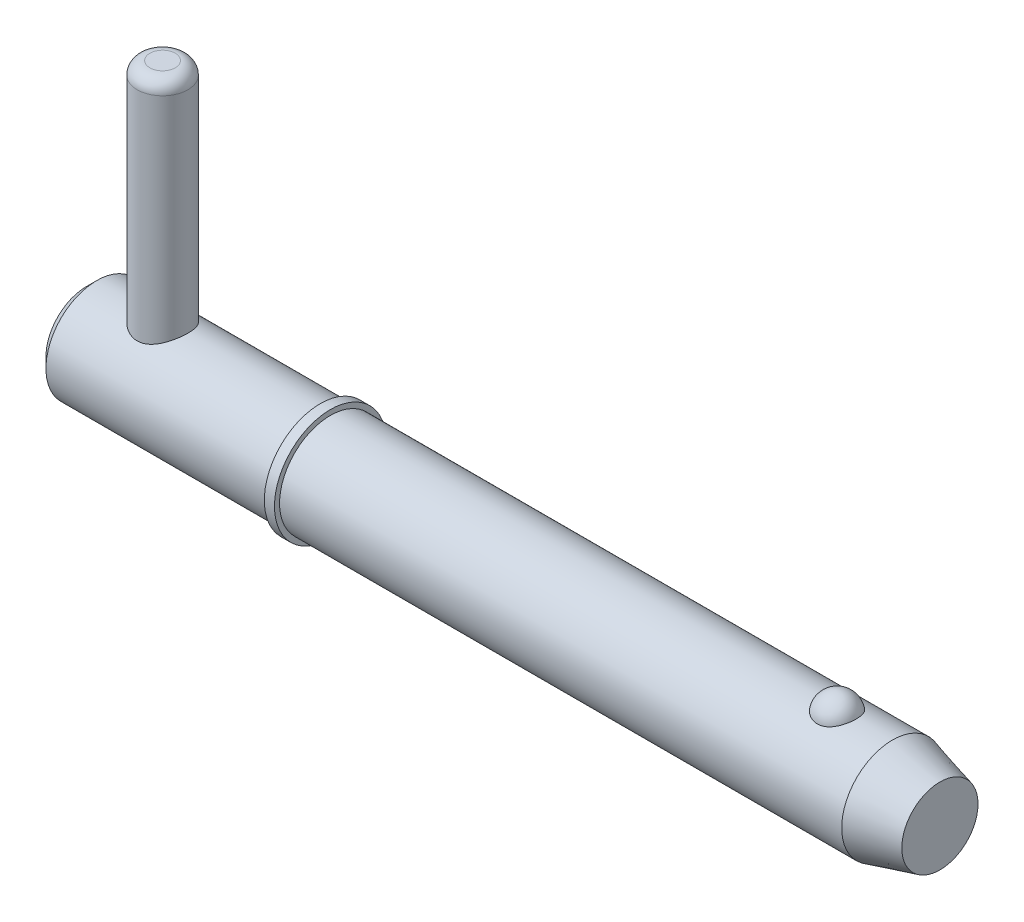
ISO-10303-21;
HEADER;
FILE_DESCRIPTION(('STEP AP214'),'2;1');
FILE_NAME('part.step','',(''),(''),'','','');
FILE_SCHEMA(('AUTOMOTIVE_DESIGN { 1 0 10303 214 1 1 1 1 }'));
ENDSEC;
DATA;
#1=APPLICATION_CONTEXT('core data for automotive mechanical design processes');
#2=APPLICATION_PROTOCOL_DEFINITION('international standard','automotive_design',2000,#1);
#3=PRODUCT_CONTEXT('',#1,'mechanical');
#4=PRODUCT('Part','Part','',(#3));
#5=PRODUCT_RELATED_PRODUCT_CATEGORY('part','',(#4));
#6=PRODUCT_DEFINITION_FORMATION('','',#4);
#7=PRODUCT_DEFINITION_CONTEXT('part definition',#1,'design');
#8=PRODUCT_DEFINITION('design','',#6,#7);
#9=PRODUCT_DEFINITION_SHAPE('','',#8);
#10=(LENGTH_UNIT() NAMED_UNIT(*) SI_UNIT(.MILLI.,.METRE.));
#11=(NAMED_UNIT(*) PLANE_ANGLE_UNIT() SI_UNIT($,.RADIAN.));
#12=(NAMED_UNIT(*) SI_UNIT($,.STERADIAN.) SOLID_ANGLE_UNIT());
#13=UNCERTAINTY_MEASURE_WITH_UNIT(LENGTH_MEASURE(1.E-05),#10,'distance_accuracy_value','');
#14=(GEOMETRIC_REPRESENTATION_CONTEXT(3) GLOBAL_UNCERTAINTY_ASSIGNED_CONTEXT((#13)) GLOBAL_UNIT_ASSIGNED_CONTEXT((#10,
#11,#12)) REPRESENTATION_CONTEXT('',''));
#15=CARTESIAN_POINT('',(0.,0.,0.));
#16=DIRECTION('',(0.,0.,1.));
#17=DIRECTION('',(1.,0.,0.));
#18=AXIS2_PLACEMENT_3D('',#15,#16,#17);
#19=CARTESIAN_POINT('',(5.94,21.43,0.));
#20=DIRECTION('',(0.,-1.,0.));
#21=DIRECTION('',(0.,0.,-1.));
#22=AXIS2_PLACEMENT_3D('',#19,#20,#21);
#23=CYLINDRICAL_SURFACE('',#22,1.98);
#24=CARTESIAN_POINT('',(5.94,-2.98,0.));
#25=DIRECTION('',(0.,1.,0.));
#26=DIRECTION('',(0.,0.,1.));
#27=AXIS2_PLACEMENT_3D('',#24,#25,#26);
#28=CIRCLE('',#27,1.98);
#29=CARTESIAN_POINT('',(5.94,-2.98,1.98));
#30=VERTEX_POINT('',#29);
#31=EDGE_CURVE('P0_E25',#30,#30,#28,.T.);
#32=ORIENTED_EDGE('',*,*,#31,.T.);
#33=EDGE_LOOP('',(#32));
#34=FACE_BOUND('',#33,.T.);
#35=CARTESIAN_POINT('',(5.94,20.44,0.));
#36=DIRECTION('',(0.,1.,0.));
#37=DIRECTION('',(0.,0.,1.));
#38=AXIS2_PLACEMENT_3D('',#35,#36,#37);
#39=CIRCLE('',#38,1.98);
#40=CARTESIAN_POINT('',(5.94,20.44,1.98));
#41=VERTEX_POINT('',#40);
#42=EDGE_CURVE('P0_E29',#41,#41,#39,.F.);
#43=ORIENTED_EDGE('',*,*,#42,.T.);
#44=EDGE_LOOP('',(#43));
#45=FACE_BOUND('',#44,.T.);
#46=ADVANCED_FACE('P0_F14',(#34,#45),#23,.T.);
#47=CARTESIAN_POINT('',(5.94,21.43,0.));
#48=DIRECTION('',(0.,1.,0.));
#49=DIRECTION('',(0.,0.,1.));
#50=AXIS2_PLACEMENT_3D('',#47,#48,#49);
#51=PLANE('',#50);
#52=CARTESIAN_POINT('',(5.94,21.43,0.));
#53=DIRECTION('',(0.,1.,0.));
#54=DIRECTION('',(0.,0.,1.));
#55=AXIS2_PLACEMENT_3D('',#52,#53,#54);
#56=CIRCLE('',#55,0.99);
#57=CARTESIAN_POINT('',(5.94,21.43,0.99));
#58=VERTEX_POINT('',#57);
#59=EDGE_CURVE('P0_E10',#58,#58,#56,.T.);
#60=ORIENTED_EDGE('',*,*,#59,.T.);
#61=EDGE_LOOP('',(#60));
#62=FACE_BOUND('',#61,.T.);
#63=ADVANCED_FACE('P0_F46',(#62),#51,.T.);
#64=CARTESIAN_POINT('',(5.94,-3.97,0.));
#65=DIRECTION('',(0.,1.,0.));
#66=DIRECTION('',(0.,0.,1.));
#67=AXIS2_PLACEMENT_3D('',#64,#65,#66);
#68=PLANE('',#67);
#69=CARTESIAN_POINT('',(5.94,-3.97,0.));
#70=DIRECTION('',(0.,1.,0.));
#71=DIRECTION('',(0.,0.,1.));
#72=AXIS2_PLACEMENT_3D('',#69,#70,#71);
#73=CIRCLE('',#72,0.99);
#74=CARTESIAN_POINT('',(5.94,-3.97,0.99));
#75=VERTEX_POINT('',#74);
#76=EDGE_CURVE('P0_E21',#75,#75,#73,.F.);
#77=ORIENTED_EDGE('',*,*,#76,.T.);
#78=EDGE_LOOP('',(#77));
#79=FACE_BOUND('',#78,.T.);
#80=ADVANCED_FACE('P0_F43',(#79),#68,.F.);
#81=CARTESIAN_POINT('',(5.94,-2.98,0.));
#82=DIRECTION('',(0.,1.,0.));
#83=DIRECTION('',(0.,0.,1.));
#84=AXIS2_PLACEMENT_3D('',#81,#82,#83);
#85=DEGENERATE_TOROIDAL_SURFACE('',#84,0.99,0.99,.T.);
#86=ORIENTED_EDGE('',*,*,#76,.F.);
#87=EDGE_LOOP('',(#86));
#88=FACE_BOUND('',#87,.T.);
#89=ORIENTED_EDGE('',*,*,#31,.F.);
#90=EDGE_LOOP('',(#89));
#91=FACE_BOUND('',#90,.T.);
#92=ADVANCED_FACE('P0_F38',(#88,#91),#85,.T.);
#93=CARTESIAN_POINT('',(5.94,20.44,0.));
#94=DIRECTION('',(0.,1.,0.));
#95=DIRECTION('',(0.,0.,1.));
#96=AXIS2_PLACEMENT_3D('',#93,#94,#95);
#97=DEGENERATE_TOROIDAL_SURFACE('',#96,0.99,0.99,.T.);
#98=ORIENTED_EDGE('',*,*,#42,.F.);
#99=EDGE_LOOP('',(#98));
#100=FACE_BOUND('',#99,.T.);
#101=ORIENTED_EDGE('',*,*,#59,.F.);
#102=EDGE_LOOP('',(#101));
#103=FACE_BOUND('',#102,.T.);
#104=ADVANCED_FACE('P0_F16',(#100,#103),#97,.T.);
#105=CLOSED_SHELL('',(#46,#63,#80,#92,#104));
#106=MANIFOLD_SOLID_BREP('P0_B1',#105);
#107=CARTESIAN_POINT('',(0.,0.,0.));
#108=DIRECTION('',(1.,0.,0.));
#109=DIRECTION('',(0.,0.,-1.));
#110=AXIS2_PLACEMENT_3D('',#107,#108,#109);
#111=CYLINDRICAL_SURFACE('',#110,3.97);
#112=CARTESIAN_POINT('',(62.9759395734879,0.,0.));
#113=DIRECTION('',(1.,0.,0.));
#114=DIRECTION('',(0.,0.,-1.));
#115=AXIS2_PLACEMENT_3D('',#112,#113,#114);
#116=CIRCLE('',#115,3.97);
#117=CARTESIAN_POINT('',(62.9759395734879,0.,-3.97));
#118=VERTEX_POINT('',#117);
#119=EDGE_CURVE('P1_E81',#118,#118,#116,.T.);
#120=ORIENTED_EDGE('',*,*,#119,.F.);
#121=EDGE_LOOP('',(#120));
#122=FACE_BOUND('',#121,.T.);
#123=CARTESIAN_POINT('',(19.05,0.,0.));
#124=DIRECTION('',(1.,0.,0.));
#125=DIRECTION('',(0.,0.,-1.));
#126=AXIS2_PLACEMENT_3D('',#123,#124,#125);
#127=CIRCLE('',#126,3.97);
#128=CARTESIAN_POINT('',(19.05,0.,-3.97));
#129=VERTEX_POINT('',#128);
#130=EDGE_CURVE('P1_E85',#129,#129,#127,.T.);
#131=ORIENTED_EDGE('',*,*,#130,.T.);
#132=EDGE_LOOP('',(#131));
#133=FACE_BOUND('',#132,.T.);
#134=CARTESIAN_POINT('',(58.6451922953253,3.65715365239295,1.54470941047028));
#135=CARTESIAN_POINT('',(58.5652448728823,3.65716001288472,1.54470290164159));
#136=CARTESIAN_POINT('',(58.4851650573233,3.65987074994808,1.53832549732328));
#137=CARTESIAN_POINT('',(58.3272374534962,3.6704221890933,1.51297018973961));
#138=CARTESIAN_POINT('',(58.2493961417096,3.67827646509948,1.49395894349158));
#139=CARTESIAN_POINT('',(58.0984614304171,3.69818848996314,1.44395950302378));
#140=CARTESIAN_POINT('',(58.0253560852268,3.71023513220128,1.41300293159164));
#141=CARTESIAN_POINT('',(57.8855630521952,3.7372183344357,1.34000212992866));
#142=CARTESIAN_POINT('',(57.8188725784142,3.75215363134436,1.29796274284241));
#143=CARTESIAN_POINT('',(57.6914886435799,3.78384968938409,1.20248834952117));
#144=CARTESIAN_POINT('',(57.6310299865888,3.80065129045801,1.14875388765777));
#145=CARTESIAN_POINT('',(57.5196942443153,3.83398532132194,1.03205417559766));
#146=CARTESIAN_POINT('',(57.4688200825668,3.85051766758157,0.969086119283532));
#147=CARTESIAN_POINT('',(57.3756321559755,3.88238608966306,0.832526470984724));
#148=CARTESIAN_POINT('',(57.3337961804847,3.89763698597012,0.758588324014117));
#149=CARTESIAN_POINT('',(57.2625108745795,3.92451063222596,0.604352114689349));
#150=CARTESIAN_POINT('',(57.2330623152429,3.93613315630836,0.524053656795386));
#151=CARTESIAN_POINT('',(57.1868927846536,3.95467606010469,0.358403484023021));
#152=CARTESIAN_POINT('',(57.1703127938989,3.96154426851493,0.273006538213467));
#153=CARTESIAN_POINT('',(57.150756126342,3.96967008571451,0.100408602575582));
#154=CARTESIAN_POINT('',(57.1477789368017,3.97092790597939,0.0132076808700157));
#155=CARTESIAN_POINT('',(57.1554587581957,3.96771794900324,-0.159844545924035));
#156=CARTESIAN_POINT('',(57.1660164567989,3.96329187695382,-0.245701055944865));
#157=CARTESIAN_POINT('',(57.2003800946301,3.94923163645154,-0.414277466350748));
#158=CARTESIAN_POINT('',(57.2241862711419,3.93959737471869,-0.496997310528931));
#159=CARTESIAN_POINT('',(57.2846114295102,3.91607752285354,-0.657113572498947));
#160=CARTESIAN_POINT('',(57.3212495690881,3.90218558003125,-0.734501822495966));
#161=CARTESIAN_POINT('',(57.4065935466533,3.87158287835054,-0.881704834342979));
#162=CARTESIAN_POINT('',(57.4553004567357,3.8548718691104,-0.951518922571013));
#163=CARTESIAN_POINT('',(57.5641161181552,3.82028735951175,-1.08208159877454));
#164=CARTESIAN_POINT('',(57.6242955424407,3.80240713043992,-1.14276958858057));
#165=CARTESIAN_POINT('',(57.754493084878,3.76758161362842,-1.2528243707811));
#166=CARTESIAN_POINT('',(57.8245105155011,3.75063626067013,-1.30219195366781));
#167=CARTESIAN_POINT('',(57.97118160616,3.71998948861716,-1.38729709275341));
#168=CARTESIAN_POINT('',(58.0476813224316,3.70623183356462,-1.42327904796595));
#169=CARTESIAN_POINT('',(58.2062981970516,3.68323188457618,-1.48178996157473));
#170=CARTESIAN_POINT('',(58.2884132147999,3.67398788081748,-1.5043240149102));
#171=CARTESIAN_POINT('',(58.4514810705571,3.6615216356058,-1.53440939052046));
#172=CARTESIAN_POINT('',(58.5322840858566,3.65801951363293,-1.54265826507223));
#173=CARTESIAN_POINT('',(58.6942085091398,3.65657341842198,-1.5460842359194));
#174=CARTESIAN_POINT('',(58.7753298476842,3.65862829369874,-1.54126404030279));
#175=CARTESIAN_POINT('',(58.9328122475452,3.66788969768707,-1.51908474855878));
#176=CARTESIAN_POINT('',(59.0092422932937,3.67492621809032,-1.50213925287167));
#177=CARTESIAN_POINT('',(59.1580412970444,3.69318404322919,-1.45666982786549));
#178=CARTESIAN_POINT('',(59.2304099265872,3.70440568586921,-1.42814496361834));
#179=CARTESIAN_POINT('',(59.3708029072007,3.73012749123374,-1.35956319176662));
#180=CARTESIAN_POINT('',(59.4387000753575,3.74469307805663,-1.31927107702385));
#181=CARTESIAN_POINT('',(59.5668649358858,3.77545272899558,-1.22847440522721));
#182=CARTESIAN_POINT('',(59.6271308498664,3.79164717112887,-1.17796747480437));
#183=CARTESIAN_POINT('',(59.7416346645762,3.82490325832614,-1.06519260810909));
#184=CARTESIAN_POINT('',(59.7954137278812,3.84196735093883,-1.00245914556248));
#185=CARTESIAN_POINT('',(59.8920988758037,3.87439863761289,-0.86871586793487));
#186=CARTESIAN_POINT('',(59.9350030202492,3.88976552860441,-0.797704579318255));
#187=CARTESIAN_POINT('',(60.010266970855,3.91771381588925,-0.646896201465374));
#188=CARTESIAN_POINT('',(60.0422532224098,3.93019255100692,-0.566893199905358));
#189=CARTESIAN_POINT('',(60.0931101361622,3.95043886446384,-0.402255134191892));
#190=CARTESIAN_POINT('',(60.1119807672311,3.95820643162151,-0.317620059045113));
#191=CARTESIAN_POINT('',(60.1362162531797,3.96823733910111,-0.146156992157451));
#192=CARTESIAN_POINT('',(60.1415874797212,3.970503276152,-0.0593300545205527));
#193=CARTESIAN_POINT('',(60.1387309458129,3.96930811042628,0.114057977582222));
#194=CARTESIAN_POINT('',(60.130503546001,3.9658471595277,0.200619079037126));
#195=CARTESIAN_POINT('',(60.1007063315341,3.95358562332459,0.370506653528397));
#196=CARTESIAN_POINT('',(60.0792129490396,3.94481563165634,0.453848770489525));
#197=CARTESIAN_POINT('',(60.0233839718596,3.92284586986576,0.615497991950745));
#198=CARTESIAN_POINT('',(59.9890474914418,3.90964579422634,0.69380474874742));
#199=CARTESIAN_POINT('',(59.9079702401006,3.88006987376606,0.843703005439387));
#200=CARTESIAN_POINT('',(59.8611536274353,3.86367478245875,0.915249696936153));
#201=CARTESIAN_POINT('',(59.7561897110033,3.82949741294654,1.04910810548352));
#202=CARTESIAN_POINT('',(59.6980428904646,3.81171519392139,1.11142021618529));
#203=CARTESIAN_POINT('',(59.5717433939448,3.77673366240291,1.22503948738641));
#204=CARTESIAN_POINT('',(59.5035970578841,3.75953398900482,1.27635357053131));
#205=CARTESIAN_POINT('',(59.3589009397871,3.72770506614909,1.36653336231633));
#206=CARTESIAN_POINT('',(59.282348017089,3.71307678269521,1.40539439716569));
#207=CARTESIAN_POINT('',(59.1257594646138,3.68864287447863,1.46830480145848));
#208=CARTESIAN_POINT('',(59.0459307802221,3.67869017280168,1.49281289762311));
#209=CARTESIAN_POINT('',(58.8829877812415,3.66414535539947,1.52817474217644));
#210=CARTESIAN_POINT('',(58.7998840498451,3.65953723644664,1.53906926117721));
#211=CARTESIAN_POINT('',(58.6927760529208,3.6573894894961,1.54414878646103));
#212=CARTESIAN_POINT('',(58.6689900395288,3.65715175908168,1.54471134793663));
#213=CARTESIAN_POINT('',(58.6451922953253,3.65715365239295,1.54470941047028));
#214=B_SPLINE_CURVE_WITH_KNOTS('',3,(#134,#135,#136,#137,#138,#139,#140,#141,#142,#143,#144,
#145,#146,#147,#148,#149,#150,#151,#152,#153,#154,#155,#156,#157,#158,#159,#160,#161,#162,#163,
#164,#165,#166,#167,#168,#169,#170,#171,#172,#173,#174,#175,#176,#177,#178,#179,#180,#181,#182,
#183,#184,#185,#186,#187,#188,#189,#190,#191,#192,#193,#194,#195,#196,#197,#198,#199,#200,#201,
#202,#203,#204,#205,#206,#207,#208,#209,#210,#211,#212,#213),.UNSPECIFIED.,.T.,.F.,(4,2,2,2,2,2,
2,2,2,2,2,2,2,2,2,2,2,2,2,2,2,2,2,2,2,2,2,2,2,2,2,2,2,2,2,2,2,2,2,4),(0.,0.239777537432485,
0.480190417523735,0.719971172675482,0.959647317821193,1.20639040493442,1.45320863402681,
1.7109367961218,1.96868099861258,2.22921052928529,2.48973023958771,2.74834928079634,
3.00697295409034,3.26598440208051,3.52501886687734,3.78570385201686,4.04637062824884,
4.30201257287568,4.55755760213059,4.80022994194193,5.04285200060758,5.27757006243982,
5.51230707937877,5.75210128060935,5.99195126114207,6.24392810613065,6.49594987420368,
6.75588818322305,7.01582710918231,7.27564332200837,7.53545264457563,7.79377886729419,
8.0521229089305,8.31207418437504,8.57201437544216,8.83179046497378,9.09166393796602,
9.34270057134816,9.59298357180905,9.66435753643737),.UNSPECIFIED.);
#215=CARTESIAN_POINT('',(58.6451922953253,3.65715365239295,1.54470941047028));
#216=VERTEX_POINT('',#215);
#217=EDGE_CURVE('P1_E35',#216,#216,#214,.T.);
#218=ORIENTED_EDGE('',*,*,#217,.T.);
#219=EDGE_LOOP('',(#218));
#220=FACE_BOUND('',#219,.T.);
#221=ADVANCED_FACE('P1_F13',(#122,#133,#220),#111,.T.);
#222=CARTESIAN_POINT('',(0.,0.,0.));
#223=DIRECTION('',(-1.,0.,0.));
#224=DIRECTION('',(0.,0.,1.));
#225=AXIS2_PLACEMENT_3D('',#222,#223,#224);
#226=PLANE('',#225);
#227=CARTESIAN_POINT('',(0.,0.,0.));
#228=DIRECTION('',(1.,0.,0.));
#229=DIRECTION('',(0.,0.,-1.));
#230=AXIS2_PLACEMENT_3D('',#227,#228,#229);
#231=CIRCLE('',#230,3.176);
#232=CARTESIAN_POINT('',(0.,0.,-3.176));
#233=VERTEX_POINT('',#232);
#234=EDGE_CURVE('P1_E9',#233,#233,#231,.T.);
#235=ORIENTED_EDGE('',*,*,#234,.F.);
#236=EDGE_LOOP('',(#235));
#237=FACE_BOUND('',#236,.T.);
#238=ADVANCED_FACE('P1_F15',(#237),#226,.T.);
#239=CARTESIAN_POINT('',(0.793999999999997,0.,0.));
#240=DIRECTION('',(1.,0.,0.));
#241=DIRECTION('',(0.,0.,-1.));
#242=AXIS2_PLACEMENT_3D('',#239,#240,#241);
#243=CONICAL_SURFACE('',#242,3.97,0.78539816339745);
#244=ORIENTED_EDGE('',*,*,#234,.T.);
#245=EDGE_LOOP('',(#244));
#246=FACE_BOUND('',#245,.T.);
#247=CARTESIAN_POINT('',(0.793999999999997,0.,0.));
#248=DIRECTION('',(1.,0.,0.));
#249=DIRECTION('',(0.,0.,-1.));
#250=AXIS2_PLACEMENT_3D('',#247,#248,#249);
#251=CIRCLE('',#250,3.97);
#252=CARTESIAN_POINT('',(0.793999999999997,0.,-3.97));
#253=VERTEX_POINT('',#252);
#254=EDGE_CURVE('P1_E26',#253,#253,#251,.T.);
#255=ORIENTED_EDGE('',*,*,#254,.F.);
#256=EDGE_LOOP('',(#255));
#257=FACE_BOUND('',#256,.T.);
#258=ADVANCED_FACE('P1_F77',(#246,#257),#243,.T.);
#259=CARTESIAN_POINT('',(0.,0.,0.));
#260=DIRECTION('',(1.,0.,0.));
#261=DIRECTION('',(0.,0.,-1.));
#262=AXIS2_PLACEMENT_3D('',#259,#260,#261);
#263=CYLINDRICAL_SURFACE('',#262,3.97);
#264=CARTESIAN_POINT('',(5.94,-3.44100276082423,1.98));
#265=CARTESIAN_POINT('',(5.8367885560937,-3.44101282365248,1.97999171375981));
#266=CARTESIAN_POINT('',(5.73344176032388,-3.44571749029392,1.97187534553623));
#267=CARTESIAN_POINT('',(5.52991905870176,-3.46385873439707,1.93981946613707));
#268=CARTESIAN_POINT('',(5.42975031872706,-3.47731375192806,1.91584653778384));
#269=CARTESIAN_POINT('',(5.23590869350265,-3.51100678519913,1.85336773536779));
#270=CARTESIAN_POINT('',(5.14220446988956,-3.53120882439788,1.81493880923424));
#271=CARTESIAN_POINT('',(4.9625969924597,-3.57606420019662,1.72487335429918));
#272=CARTESIAN_POINT('',(4.87669412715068,-3.6007177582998,1.67323616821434));
#273=CARTESIAN_POINT('',(4.70734412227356,-3.65417020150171,1.55325205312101));
#274=CARTESIAN_POINT('',(4.62467662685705,-3.68314323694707,1.4838818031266));
#275=CARTESIAN_POINT('',(4.47154355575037,-3.74056406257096,1.33252902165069));
#276=CARTESIAN_POINT('',(4.40108404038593,-3.76901158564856,1.25054026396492));
#277=CARTESIAN_POINT('',(4.26974803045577,-3.82445556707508,1.06956584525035));
#278=CARTESIAN_POINT('',(4.20982960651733,-3.8512271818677,0.969809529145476));
#279=CARTESIAN_POINT('',(4.10798077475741,-3.89804342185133,0.760047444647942));
#280=CARTESIAN_POINT('',(4.06603907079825,-3.91809226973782,0.650048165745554));
#281=CARTESIAN_POINT('',(4.00441878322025,-3.94794912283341,0.431181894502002));
#282=CARTESIAN_POINT('',(3.98337329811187,-3.95838209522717,0.322786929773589));
#283=CARTESIAN_POINT('',(3.9596425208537,-3.97016407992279,0.103541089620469));
#284=CARTESIAN_POINT('',(3.95694618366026,-3.97151855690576,-0.00730826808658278));
#285=CARTESIAN_POINT('',(3.9694599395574,-3.96528826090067,-0.218044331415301));
#286=CARTESIAN_POINT('',(3.98314071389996,-3.95846689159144,-0.318049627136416));
#287=CARTESIAN_POINT('',(4.02528522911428,-3.93780347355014,-0.514124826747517));
#288=CARTESIAN_POINT('',(4.05375007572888,-3.92396089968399,-0.61019443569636));
#289=CARTESIAN_POINT('',(4.12484256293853,-3.89028355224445,-0.797351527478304));
#290=CARTESIAN_POINT('',(4.16766142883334,-3.87036821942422,-0.888351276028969));
#291=CARTESIAN_POINT('',(4.26598377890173,-3.82634285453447,-1.06209448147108));
#292=CARTESIAN_POINT('',(4.32149181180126,-3.8022313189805,-1.14483496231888));
#293=CARTESIAN_POINT('',(4.44962332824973,-3.74940011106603,-1.30802500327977));
#294=CARTESIAN_POINT('',(4.52336636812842,-3.72046031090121,-1.38752498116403));
#295=CARTESIAN_POINT('',(4.68287656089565,-3.66269463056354,-1.53354043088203));
#296=CARTESIAN_POINT('',(4.7686527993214,-3.63386885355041,-1.60004599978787));
#297=CARTESIAN_POINT('',(4.9564069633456,-3.57763161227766,-1.72228426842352));
#298=CARTESIAN_POINT('',(5.05906485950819,-3.5504233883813,-1.77707534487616));
#299=CARTESIAN_POINT('',(5.27381412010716,-3.50334038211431,-1.86819784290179));
#300=CARTESIAN_POINT('',(5.38589553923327,-3.48345798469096,-1.90454844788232));
#301=CARTESIAN_POINT('',(5.6069795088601,-3.45548331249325,-1.95481643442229));
#302=CARTESIAN_POINT('',(5.71552407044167,-3.44658268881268,-1.97028113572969));
#303=CARTESIAN_POINT('',(5.93399639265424,-3.43928114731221,-1.98300600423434));
#304=CARTESIAN_POINT('',(6.04392313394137,-3.44087289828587,-1.98027888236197));
#305=CARTESIAN_POINT('',(6.24931618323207,-3.45351901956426,-1.95811780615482));
#306=CARTESIAN_POINT('',(6.34505668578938,-3.46352725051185,-1.94052989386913));
#307=CARTESIAN_POINT('',(6.53204702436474,-3.49033612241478,-1.89188242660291));
#308=CARTESIAN_POINT('',(6.62329540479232,-3.50713894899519,-1.86081853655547));
#309=CARTESIAN_POINT('',(6.80352105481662,-3.54655680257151,-1.78458666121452));
#310=CARTESIAN_POINT('',(6.89219712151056,-3.56940508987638,-1.73883178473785));
#311=CARTESIAN_POINT('',(7.06112449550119,-3.61813012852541,-1.63502913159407));
#312=CARTESIAN_POINT('',(7.14137144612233,-3.6440084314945,-1.57697504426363));
#313=CARTESIAN_POINT('',(7.30168083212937,-3.69977514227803,-1.44171920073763));
#314=CARTESIAN_POINT('',(7.38046039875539,-3.7297597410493,-1.36302972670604));
#315=CARTESIAN_POINT('',(7.52409649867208,-3.78754991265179,-1.19307190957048));
#316=CARTESIAN_POINT('',(7.58894840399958,-3.81535475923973,-1.10179940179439));
#317=CARTESIAN_POINT('',(7.70430122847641,-3.86658972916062,-0.906019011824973));
#318=CARTESIAN_POINT('',(7.75438714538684,-3.88988795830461,-0.801229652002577));
#319=CARTESIAN_POINT('',(7.83572184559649,-3.92848199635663,-0.583216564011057));
#320=CARTESIAN_POINT('',(7.86698708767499,-3.94378479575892,-0.470000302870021));
#321=CARTESIAN_POINT('',(7.90711051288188,-3.96355307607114,-0.249525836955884));
#322=CARTESIAN_POINT('',(7.91775648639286,-3.96888171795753,-0.142669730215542));
#323=CARTESIAN_POINT('',(7.92160247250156,-3.97079858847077,0.0714191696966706));
#324=CARTESIAN_POINT('',(7.91480852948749,-3.96738984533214,0.178651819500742));
#325=CARTESIAN_POINT('',(7.88515479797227,-3.9527181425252,0.383072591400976));
#326=CARTESIAN_POINT('',(7.8633739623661,-3.94198303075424,0.480459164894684));
#327=CARTESIAN_POINT('',(7.80581513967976,-3.91422178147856,0.670038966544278));
#328=CARTESIAN_POINT('',(7.77003513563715,-3.89719473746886,0.762231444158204));
#329=CARTESIAN_POINT('',(7.68389191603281,-3.85747818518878,0.943248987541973));
#330=CARTESIAN_POINT('',(7.63296879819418,-3.83457704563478,1.03175978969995));
#331=CARTESIAN_POINT('',(7.51869140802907,-3.7855122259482,1.19934744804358));
#332=CARTESIAN_POINT('',(7.45533142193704,-3.75934704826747,1.2784199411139));
#333=CARTESIAN_POINT('',(7.31068939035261,-3.70329841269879,1.433144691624));
#334=CARTESIAN_POINT('',(7.22825362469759,-3.67330340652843,1.50768183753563));
#335=CARTESIAN_POINT('',(7.05162367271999,-3.61514025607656,1.64226879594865));
#336=CARTESIAN_POINT('',(6.95741928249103,-3.58697372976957,1.70230590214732));
#337=CARTESIAN_POINT('',(6.75590859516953,-3.53504049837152,1.80775364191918));
#338=CARTESIAN_POINT('',(6.64828786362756,-3.51143624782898,1.85265616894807));
#339=CARTESIAN_POINT('',(6.48137774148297,-3.48289659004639,1.90544537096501));
#340=CARTESIAN_POINT('',(6.42488151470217,-3.4745323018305,1.9206071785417));
#341=CARTESIAN_POINT('',(6.31046920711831,-3.4604244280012,1.94591259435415));
#342=CARTESIAN_POINT('',(6.25255415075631,-3.45467900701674,1.95605971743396));
#343=CARTESIAN_POINT('',(6.1521444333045,-3.44728060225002,1.96905939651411));
#344=CARTESIAN_POINT('',(6.10985721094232,-3.44493297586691,1.97315742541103));
#345=CARTESIAN_POINT('',(6.02505433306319,-3.44179192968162,1.97862952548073));
#346=CARTESIAN_POINT('',(5.98253866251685,-3.44099861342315,1.98000341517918));
#347=CARTESIAN_POINT('',(5.94,-3.44100276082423,1.98));
#348=B_SPLINE_CURVE_WITH_KNOTS('',3,(#264,#265,#266,#267,#268,#269,#270,#271,#272,#273,#274,
#275,#276,#277,#278,#279,#280,#281,#282,#283,#284,#285,#286,#287,#288,#289,#290,#291,#292,#293,
#294,#295,#296,#297,#298,#299,#300,#301,#302,#303,#304,#305,#306,#307,#308,#309,#310,#311,#312,
#313,#314,#315,#316,#317,#318,#319,#320,#321,#322,#323,#324,#325,#326,#327,#328,#329,#330,#331,
#332,#333,#334,#335,#336,#337,#338,#339,#340,#341,#342,#343,#344,#345,#346,#347),.UNSPECIFIED.,
.T.,.F.,(4,2,2,2,2,2,2,2,2,2,2,2,2,2,2,2,2,2,2,2,2,2,2,2,2,2,2,2,2,2,2,2,2,2,2,2,2,2,2,2,2,4),
(0.,0.309462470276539,0.619579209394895,0.928068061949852,1.23657226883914,1.57038619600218,
1.90436536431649,2.26071614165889,2.61684266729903,2.94773555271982,3.27842924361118,
3.58050679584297,3.88260694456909,4.18890317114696,4.49530936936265,4.83057163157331,
5.1660884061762,5.52272472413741,5.87898927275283,6.20706708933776,6.53491569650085,
6.82716910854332,7.11951660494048,7.42541184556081,7.73146442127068,8.07586334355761,
8.42037652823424,8.77380887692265,9.12693169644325,9.44775848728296,9.76847409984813,
10.0682302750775,10.3680296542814,10.6806938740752,10.9935020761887,11.3373031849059,
11.6814044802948,12.0361164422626,12.2131519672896,12.3900632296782,12.5175998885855,
12.6451450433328),.UNSPECIFIED.);
#349=CARTESIAN_POINT('',(5.94,-3.44100276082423,1.98));
#350=VERTEX_POINT('',#349);
#351=EDGE_CURVE('P1_E17',#350,#350,#348,.T.);
#352=ORIENTED_EDGE('',*,*,#351,.F.);
#353=EDGE_LOOP('',(#352));
#354=FACE_BOUND('',#353,.T.);
#355=CARTESIAN_POINT('',(5.94,3.44100276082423,1.98));
#356=CARTESIAN_POINT('',(6.0432114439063,3.44101282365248,1.97999171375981));
#357=CARTESIAN_POINT('',(6.14655823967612,3.44571749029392,1.97187534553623));
#358=CARTESIAN_POINT('',(6.35008094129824,3.46385873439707,1.93981946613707));
#359=CARTESIAN_POINT('',(6.45024968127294,3.47731375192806,1.91584653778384));
#360=CARTESIAN_POINT('',(6.64409130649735,3.51100678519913,1.85336773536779));
#361=CARTESIAN_POINT('',(6.73779553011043,3.53120882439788,1.81493880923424));
#362=CARTESIAN_POINT('',(6.91740300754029,3.57606420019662,1.72487335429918));
#363=CARTESIAN_POINT('',(7.00330587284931,3.6007177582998,1.67323616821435));
#364=CARTESIAN_POINT('',(7.17265587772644,3.65417020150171,1.55325205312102));
#365=CARTESIAN_POINT('',(7.25532337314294,3.68314323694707,1.4838818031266));
#366=CARTESIAN_POINT('',(7.40845644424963,3.74056406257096,1.3325290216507));
#367=CARTESIAN_POINT('',(7.47891595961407,3.76901158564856,1.25054026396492));
#368=CARTESIAN_POINT('',(7.61025196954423,3.82445556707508,1.06956584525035));
#369=CARTESIAN_POINT('',(7.67017039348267,3.8512271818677,0.969809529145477));
#370=CARTESIAN_POINT('',(7.77201922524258,3.89804342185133,0.760047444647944));
#371=CARTESIAN_POINT('',(7.81396092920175,3.91809226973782,0.650048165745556));
#372=CARTESIAN_POINT('',(7.87558121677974,3.94794912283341,0.431181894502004));
#373=CARTESIAN_POINT('',(7.89662670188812,3.95838209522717,0.322786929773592));
#374=CARTESIAN_POINT('',(7.9203574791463,3.97016407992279,0.103541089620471));
#375=CARTESIAN_POINT('',(7.92305381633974,3.97151855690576,-0.00730826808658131));
#376=CARTESIAN_POINT('',(7.9105400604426,3.96528826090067,-0.2180443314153));
#377=CARTESIAN_POINT('',(7.89685928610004,3.95846689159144,-0.318049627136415));
#378=CARTESIAN_POINT('',(7.85471477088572,3.93780347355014,-0.514124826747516));
#379=CARTESIAN_POINT('',(7.82624992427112,3.92396089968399,-0.61019443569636));
#380=CARTESIAN_POINT('',(7.75515743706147,3.89028355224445,-0.797351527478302));
#381=CARTESIAN_POINT('',(7.71233857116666,3.87036821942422,-0.888351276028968));
#382=CARTESIAN_POINT('',(7.61401622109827,3.82634285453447,-1.06209448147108));
#383=CARTESIAN_POINT('',(7.55850818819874,3.8022313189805,-1.14483496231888));
#384=CARTESIAN_POINT('',(7.43037667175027,3.74940011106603,-1.30802500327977));
#385=CARTESIAN_POINT('',(7.35663363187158,3.72046031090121,-1.38752498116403));
#386=CARTESIAN_POINT('',(7.19712343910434,3.66269463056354,-1.53354043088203));
#387=CARTESIAN_POINT('',(7.1113472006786,3.63386885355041,-1.60004599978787));
#388=CARTESIAN_POINT('',(6.9235930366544,3.57763161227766,-1.72228426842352));
#389=CARTESIAN_POINT('',(6.82093514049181,3.5504233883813,-1.77707534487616));
#390=CARTESIAN_POINT('',(6.60618587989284,3.50334038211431,-1.86819784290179));
#391=CARTESIAN_POINT('',(6.49410446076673,3.48345798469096,-1.90454844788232));
#392=CARTESIAN_POINT('',(6.2730204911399,3.45548331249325,-1.95481643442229));
#393=CARTESIAN_POINT('',(6.16447592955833,3.44658268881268,-1.97028113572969));
#394=CARTESIAN_POINT('',(5.94600360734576,3.43928114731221,-1.98300600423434));
#395=CARTESIAN_POINT('',(5.83607686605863,3.44087289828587,-1.98027888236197));
#396=CARTESIAN_POINT('',(5.63068381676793,3.45351901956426,-1.95811780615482));
#397=CARTESIAN_POINT('',(5.53494331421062,3.46352725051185,-1.94052989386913));
#398=CARTESIAN_POINT('',(5.34795297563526,3.49033612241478,-1.89188242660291));
#399=CARTESIAN_POINT('',(5.25670459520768,3.50713894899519,-1.86081853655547));
#400=CARTESIAN_POINT('',(5.07647894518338,3.54655680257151,-1.78458666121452));
#401=CARTESIAN_POINT('',(4.98780287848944,3.56940508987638,-1.73883178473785));
#402=CARTESIAN_POINT('',(4.81887550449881,3.61813012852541,-1.63502913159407));
#403=CARTESIAN_POINT('',(4.73862855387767,3.6440084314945,-1.57697504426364));
#404=CARTESIAN_POINT('',(4.57831916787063,3.69977514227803,-1.44171920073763));
#405=CARTESIAN_POINT('',(4.49953960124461,3.7297597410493,-1.36302972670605));
#406=CARTESIAN_POINT('',(4.35590350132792,3.78754991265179,-1.19307190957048));
#407=CARTESIAN_POINT('',(4.29105159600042,3.81535475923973,-1.10179940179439));
#408=CARTESIAN_POINT('',(4.17569877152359,3.86658972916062,-0.906019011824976));
#409=CARTESIAN_POINT('',(4.12561285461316,3.88988795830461,-0.80122965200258));
#410=CARTESIAN_POINT('',(4.04427815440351,3.92848199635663,-0.58321656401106));
#411=CARTESIAN_POINT('',(4.01301291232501,3.94378479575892,-0.470000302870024));
#412=CARTESIAN_POINT('',(3.97288948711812,3.96355307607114,-0.249525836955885));
#413=CARTESIAN_POINT('',(3.96224351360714,3.96888171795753,-0.142669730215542));
#414=CARTESIAN_POINT('',(3.95839752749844,3.97079858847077,0.0714191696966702));
#415=CARTESIAN_POINT('',(3.96519147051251,3.96738984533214,0.178651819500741));
#416=CARTESIAN_POINT('',(3.99484520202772,3.9527181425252,0.383072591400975));
#417=CARTESIAN_POINT('',(4.01662603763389,3.94198303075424,0.480459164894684));
#418=CARTESIAN_POINT('',(4.07418486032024,3.91422178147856,0.670038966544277));
#419=CARTESIAN_POINT('',(4.10996486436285,3.89719473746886,0.762231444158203));
#420=CARTESIAN_POINT('',(4.19610808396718,3.85747818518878,0.943248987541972));
#421=CARTESIAN_POINT('',(4.24703120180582,3.83457704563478,1.03175978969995));
#422=CARTESIAN_POINT('',(4.36130859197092,3.7855122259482,1.19934744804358));
#423=CARTESIAN_POINT('',(4.42466857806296,3.75934704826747,1.2784199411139));
#424=CARTESIAN_POINT('',(4.56931060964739,3.70329841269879,1.433144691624));
#425=CARTESIAN_POINT('',(4.65174637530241,3.67330340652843,1.50768183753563));
#426=CARTESIAN_POINT('',(4.82837632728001,3.61514025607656,1.64226879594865));
#427=CARTESIAN_POINT('',(4.92258071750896,3.58697372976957,1.70230590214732));
#428=CARTESIAN_POINT('',(5.12409140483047,3.53504049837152,1.80775364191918));
#429=CARTESIAN_POINT('',(5.23171213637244,3.51143624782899,1.85265616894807));
#430=CARTESIAN_POINT('',(5.39862225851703,3.48289659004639,1.90544537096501));
#431=CARTESIAN_POINT('',(5.45511848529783,3.4745323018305,1.9206071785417));
#432=CARTESIAN_POINT('',(5.56953079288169,3.4604244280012,1.94591259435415));
#433=CARTESIAN_POINT('',(5.62744584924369,3.45467900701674,1.95605971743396));
#434=CARTESIAN_POINT('',(5.7278555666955,3.44728060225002,1.9690593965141));
#435=CARTESIAN_POINT('',(5.77014278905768,3.44493297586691,1.97315742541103));
#436=CARTESIAN_POINT('',(5.85494566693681,3.44179192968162,1.97862952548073));
#437=CARTESIAN_POINT('',(5.89746133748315,3.44099861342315,1.98000341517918));
#438=CARTESIAN_POINT('',(5.94,3.44100276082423,1.98));
#439=B_SPLINE_CURVE_WITH_KNOTS('',3,(#355,#356,#357,#358,#359,#360,#361,#362,#363,#364,#365,
#366,#367,#368,#369,#370,#371,#372,#373,#374,#375,#376,#377,#378,#379,#380,#381,#382,#383,#384,
#385,#386,#387,#388,#389,#390,#391,#392,#393,#394,#395,#396,#397,#398,#399,#400,#401,#402,#403,
#404,#405,#406,#407,#408,#409,#410,#411,#412,#413,#414,#415,#416,#417,#418,#419,#420,#421,#422,
#423,#424,#425,#426,#427,#428,#429,#430,#431,#432,#433,#434,#435,#436,#437,#438),.UNSPECIFIED.,
.T.,.F.,(4,2,2,2,2,2,2,2,2,2,2,2,2,2,2,2,2,2,2,2,2,2,2,2,2,2,2,2,2,2,2,2,2,2,2,2,2,2,2,2,2,4),
(0.,0.309462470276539,0.619579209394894,0.928068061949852,1.23657226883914,1.57038619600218,
1.90436536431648,2.26071614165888,2.61684266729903,2.94773555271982,3.27842924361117,
3.58050679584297,3.88260694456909,4.18890317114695,4.49530936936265,4.83057163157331,
5.1660884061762,5.5227247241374,5.87898927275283,6.20706708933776,6.53491569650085,
6.82716910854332,7.11951660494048,7.42541184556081,7.73146442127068,8.07586334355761,
8.42037652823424,8.77380887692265,9.12693169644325,9.44775848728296,9.76847409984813,
10.0682302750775,10.3680296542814,10.6806938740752,10.9935020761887,11.3373031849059,
11.6814044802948,12.0361164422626,12.2131519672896,12.3900632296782,12.5175998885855,
12.6451450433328),.UNSPECIFIED.);
#440=CARTESIAN_POINT('',(5.94,3.44100276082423,1.98));
#441=VERTEX_POINT('',#440);
#442=EDGE_CURVE('P1_E43',#441,#441,#439,.T.);
#443=ORIENTED_EDGE('',*,*,#442,.F.);
#444=EDGE_LOOP('',(#443));
#445=FACE_BOUND('',#444,.T.);
#446=ORIENTED_EDGE('',*,*,#254,.T.);
#447=EDGE_LOOP('',(#446));
#448=FACE_BOUND('',#447,.T.);
#449=CARTESIAN_POINT('',(18.256,0.,0.));
#450=DIRECTION('',(1.,0.,0.));
#451=DIRECTION('',(0.,0.,-1.));
#452=AXIS2_PLACEMENT_3D('',#449,#450,#451);
#453=CIRCLE('',#452,3.97);
#454=CARTESIAN_POINT('',(18.256,0.,-3.97));
#455=VERTEX_POINT('',#454);
#456=EDGE_CURVE('P1_E31',#455,#455,#453,.T.);
#457=ORIENTED_EDGE('',*,*,#456,.F.);
#458=EDGE_LOOP('',(#457));
#459=FACE_BOUND('',#458,.T.);
#460=ADVANCED_FACE('P1_F103',(#354,#445,#448,#459),#263,.T.);
#461=CARTESIAN_POINT('',(18.256,3.97,0.));
#462=DIRECTION('',(-1.,0.,0.));
#463=DIRECTION('',(0.,0.,1.));
#464=AXIS2_PLACEMENT_3D('',#461,#462,#463);
#465=PLANE('',#464);
#466=ORIENTED_EDGE('',*,*,#456,.T.);
#467=EDGE_LOOP('',(#466));
#468=FACE_BOUND('',#467,.T.);
#469=CARTESIAN_POINT('',(18.256,0.,0.));
#470=DIRECTION('',(1.,0.,0.));
#471=DIRECTION('',(0.,0.,-1.));
#472=AXIS2_PLACEMENT_3D('',#469,#470,#471);
#473=CIRCLE('',#472,4.367);
#474=CARTESIAN_POINT('',(18.256,0.,-4.367));
#475=VERTEX_POINT('',#474);
#476=EDGE_CURVE('P1_E91',#475,#475,#473,.T.);
#477=ORIENTED_EDGE('',*,*,#476,.F.);
#478=EDGE_LOOP('',(#477));
#479=FACE_BOUND('',#478,.T.);
#480=ADVANCED_FACE('P1_F100',(#468,#479),#465,.T.);
#481=CARTESIAN_POINT('',(0.,0.,0.));
#482=DIRECTION('',(1.,0.,0.));
#483=DIRECTION('',(0.,0.,-1.));
#484=AXIS2_PLACEMENT_3D('',#481,#482,#483);
#485=CYLINDRICAL_SURFACE('',#484,4.367);
#486=ORIENTED_EDGE('',*,*,#476,.T.);
#487=EDGE_LOOP('',(#486));
#488=FACE_BOUND('',#487,.T.);
#489=CARTESIAN_POINT('',(19.05,0.,0.));
#490=DIRECTION('',(1.,0.,0.));
#491=DIRECTION('',(0.,0.,-1.));
#492=AXIS2_PLACEMENT_3D('',#489,#490,#491);
#493=CIRCLE('',#492,4.367);
#494=CARTESIAN_POINT('',(19.05,0.,-4.367));
#495=VERTEX_POINT('',#494);
#496=EDGE_CURVE('P1_E88',#495,#495,#493,.T.);
#497=ORIENTED_EDGE('',*,*,#496,.F.);
#498=EDGE_LOOP('',(#497));
#499=FACE_BOUND('',#498,.T.);
#500=ADVANCED_FACE('P1_F68',(#488,#499),#485,.T.);
#501=CARTESIAN_POINT('',(19.05,4.367,0.));
#502=DIRECTION('',(1.,0.,0.));
#503=DIRECTION('',(0.,0.,-1.));
#504=AXIS2_PLACEMENT_3D('',#501,#502,#503);
#505=PLANE('',#504);
#506=ORIENTED_EDGE('',*,*,#496,.T.);
#507=EDGE_LOOP('',(#506));
#508=FACE_BOUND('',#507,.T.);
#509=ORIENTED_EDGE('',*,*,#130,.F.);
#510=EDGE_LOOP('',(#509));
#511=FACE_BOUND('',#510,.T.);
#512=ADVANCED_FACE('P1_F62',(#508,#511),#505,.T.);
#513=CARTESIAN_POINT('',(66.68,0.,0.));
#514=DIRECTION('',(-1.,0.,0.));
#515=DIRECTION('',(0.,0.,1.));
#516=AXIS2_PLACEMENT_3D('',#513,#514,#515);
#517=CONICAL_SURFACE('',#516,2.97750000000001,0.26179938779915);
#518=ORIENTED_EDGE('',*,*,#119,.T.);
#519=EDGE_LOOP('',(#518));
#520=FACE_BOUND('',#519,.T.);
#521=CARTESIAN_POINT('',(66.68,0.,0.));
#522=DIRECTION('',(1.,0.,0.));
#523=DIRECTION('',(0.,0.,-1.));
#524=AXIS2_PLACEMENT_3D('',#521,#522,#523);
#525=CIRCLE('',#524,2.97750000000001);
#526=CARTESIAN_POINT('',(66.68,0.,-2.97750000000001));
#527=VERTEX_POINT('',#526);
#528=EDGE_CURVE('P1_E42',#527,#527,#525,.T.);
#529=ORIENTED_EDGE('',*,*,#528,.F.);
#530=EDGE_LOOP('',(#529));
#531=FACE_BOUND('',#530,.T.);
#532=ADVANCED_FACE('P1_F59',(#520,#531),#517,.T.);
#533=CARTESIAN_POINT('',(66.68,2.97750000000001,0.));
#534=DIRECTION('',(1.,0.,0.));
#535=DIRECTION('',(0.,0.,-1.));
#536=AXIS2_PLACEMENT_3D('',#533,#534,#535);
#537=PLANE('',#536);
#538=ORIENTED_EDGE('',*,*,#528,.T.);
#539=EDGE_LOOP('',(#538));
#540=FACE_BOUND('',#539,.T.);
#541=ADVANCED_FACE('P1_F55',(#540),#537,.T.);
#542=CARTESIAN_POINT('',(58.6451922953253,3.573,0.));
#543=DIRECTION('',(-1.,0.,0.));
#544=DIRECTION('',(0.,-1.,0.));
#545=AXIS2_PLACEMENT_3D('',#542,#543,#544);
#546=SPHERICAL_SURFACE('',#545,1.54699999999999);
#547=ORIENTED_EDGE('',*,*,#217,.F.);
#548=EDGE_LOOP('',(#547));
#549=FACE_BOUND('',#548,.T.);
#550=ADVANCED_FACE('P1_F50',(#549),#546,.T.);
#551=CARTESIAN_POINT('',(5.94,-4.367,0.));
#552=DIRECTION('',(0.,1.,0.));
#553=DIRECTION('',(0.,0.,1.));
#554=AXIS2_PLACEMENT_3D('',#551,#552,#553);
#555=CYLINDRICAL_SURFACE('',#554,1.98);
#556=ORIENTED_EDGE('',*,*,#351,.T.);
#557=EDGE_LOOP('',(#556));
#558=FACE_BOUND('',#557,.T.);
#559=ORIENTED_EDGE('',*,*,#442,.T.);
#560=EDGE_LOOP('',(#559));
#561=FACE_BOUND('',#560,.T.);
#562=ADVANCED_FACE('P1_F54',(#558,#561),#555,.F.);
#563=CLOSED_SHELL('',(#221,#238,#258,#460,#480,#500,#512,#532,#541,#550,#562));
#564=MANIFOLD_SOLID_BREP('P1_B1',#563);
#565=ADVANCED_BREP_SHAPE_REPRESENTATION('',(#18,#106,#564),#14);
#566=SHAPE_DEFINITION_REPRESENTATION(#9,#565);
ENDSEC;
END-ISO-10303-21;
